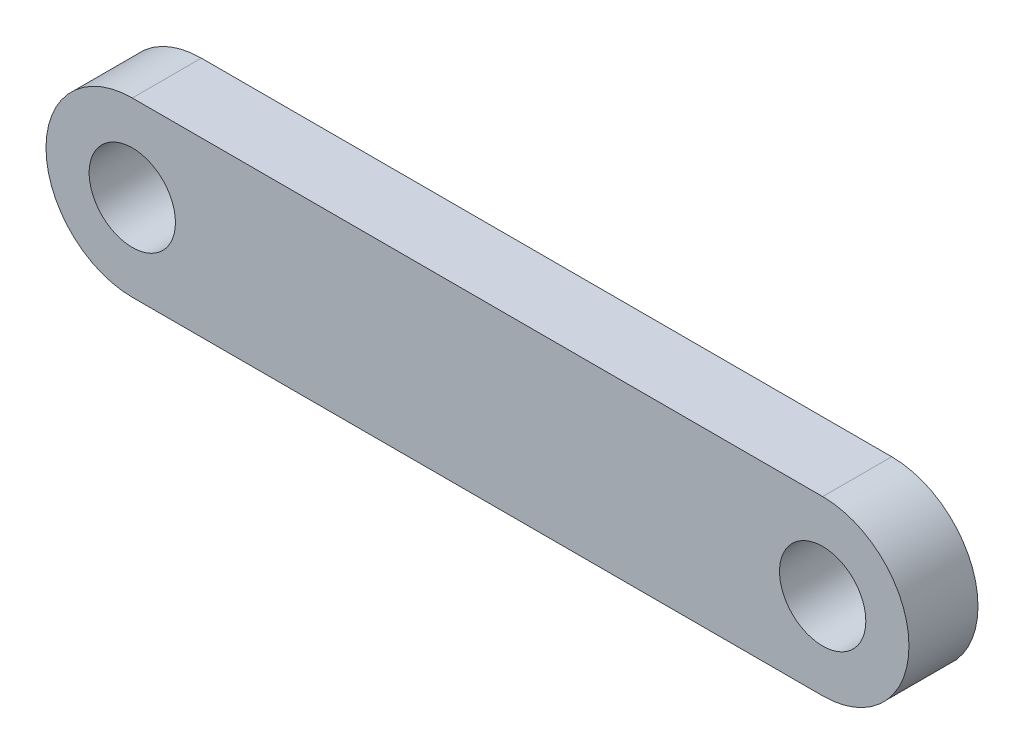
from build123d import *

# Parameters (mm, degrees)
SKETCH1_R      = 2.5
EXTRUDE2_DEPTH = 2


with BuildPart() as part:
    # Sketch1 → Extrude2 (new, symmetric)
    with BuildSketch(Plane.XY):
        with BuildLine():
            Line((0, 0), (40, 0))
            ThreePointArc((40, 0), (45, -5), (40, -10))
            Line((40, -10), (0, -10))
            ThreePointArc((0, -10), (-5, -5), (0, 0))
        make_face()
        with Locations((0, -5)):
            Circle(SKETCH1_R, mode=Mode.SUBTRACT)
        with Locations((40, -5)):
            Circle(SKETCH1_R, mode=Mode.SUBTRACT)
    extrude(amount=EXTRUDE2_DEPTH, both=True)


solid = part.part
